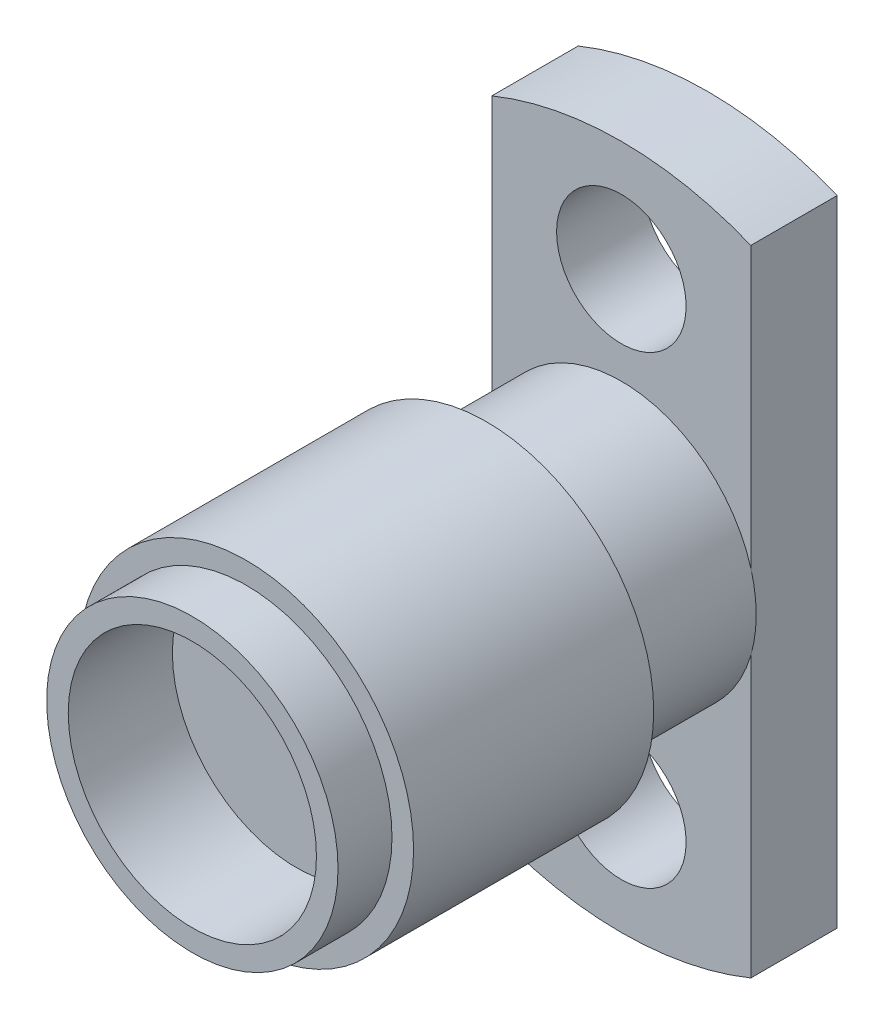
ISO-10303-21;
HEADER;
FILE_DESCRIPTION(('STEP AP214'),'2;1');
FILE_NAME('part.step','',(''),(''),'','','');
FILE_SCHEMA(('AUTOMOTIVE_DESIGN { 1 0 10303 214 1 1 1 1 }'));
ENDSEC;
DATA;
#1=APPLICATION_CONTEXT('core data for automotive mechanical design processes');
#2=APPLICATION_PROTOCOL_DEFINITION('international standard','automotive_design',2000,#1);
#3=PRODUCT_CONTEXT('',#1,'mechanical');
#4=PRODUCT('Part','Part','',(#3));
#5=PRODUCT_RELATED_PRODUCT_CATEGORY('part','',(#4));
#6=PRODUCT_DEFINITION_FORMATION('','',#4);
#7=PRODUCT_DEFINITION_CONTEXT('part definition',#1,'design');
#8=PRODUCT_DEFINITION('design','',#6,#7);
#9=PRODUCT_DEFINITION_SHAPE('','',#8);
#10=(LENGTH_UNIT() NAMED_UNIT(*) SI_UNIT(.MILLI.,.METRE.));
#11=(NAMED_UNIT(*) PLANE_ANGLE_UNIT() SI_UNIT($,.RADIAN.));
#12=(NAMED_UNIT(*) SI_UNIT($,.STERADIAN.) SOLID_ANGLE_UNIT());
#13=UNCERTAINTY_MEASURE_WITH_UNIT(LENGTH_MEASURE(1.E-05),#10,'distance_accuracy_value','');
#14=(GEOMETRIC_REPRESENTATION_CONTEXT(3) GLOBAL_UNCERTAINTY_ASSIGNED_CONTEXT((#13)) GLOBAL_UNIT_ASSIGNED_CONTEXT((#10,
#11,#12)) REPRESENTATION_CONTEXT('',''));
#15=CARTESIAN_POINT('',(0.,0.,0.));
#16=DIRECTION('',(0.,0.,1.));
#17=DIRECTION('',(1.,0.,0.));
#18=AXIS2_PLACEMENT_3D('',#15,#16,#17);
#19=CARTESIAN_POINT('',(15.3944725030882,12.7955932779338,8.55));
#20=DIRECTION('',(0.,0.,1.));
#21=DIRECTION('',(1.,0.,0.));
#22=AXIS2_PLACEMENT_3D('',#19,#20,#21);
#23=PLANE('',#22);
#24=CARTESIAN_POINT('',(15.3944725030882,12.7955932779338,8.55));
#25=DIRECTION('',(0.,0.,1.));
#26=DIRECTION('',(1.,0.,0.));
#27=AXIS2_PLACEMENT_3D('',#24,#25,#26);
#28=CIRCLE('',#27,3.1);
#29=CARTESIAN_POINT('',(18.4944725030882,12.7955932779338,8.55));
#30=VERTEX_POINT('',#29);
#31=EDGE_CURVE('E108',#30,#30,#28,.T.);
#32=ORIENTED_EDGE('',*,*,#31,.T.);
#33=EDGE_LOOP('',(#32));
#34=FACE_BOUND('',#33,.T.);
#35=CARTESIAN_POINT('',(15.3944725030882,12.7955932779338,8.55));
#36=DIRECTION('',(0.,0.,1.));
#37=DIRECTION('',(1.,0.,0.));
#38=AXIS2_PLACEMENT_3D('',#35,#36,#37);
#39=CIRCLE('',#38,2.7);
#40=CARTESIAN_POINT('',(18.0944725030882,12.7955932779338,8.55));
#41=VERTEX_POINT('',#40);
#42=EDGE_CURVE('E379',#41,#41,#39,.T.);
#43=ORIENTED_EDGE('',*,*,#42,.F.);
#44=EDGE_LOOP('',(#43));
#45=FACE_BOUND('',#44,.T.);
#46=ADVANCED_FACE('F35',(#34,#45),#23,.T.);
#47=CARTESIAN_POINT('',(15.3944725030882,12.7955932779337,1.6));
#48=DIRECTION('',(0.,0.,-1.));
#49=DIRECTION('',(-1.,0.,0.));
#50=AXIS2_PLACEMENT_3D('',#47,#48,#49);
#51=PLANE('',#50);
#52=CARTESIAN_POINT('',(15.3944725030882,17.0955932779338,1.6));
#53=DIRECTION('',(0.,0.,-1.));
#54=DIRECTION('',(-1.,0.,0.));
#55=AXIS2_PLACEMENT_3D('',#52,#53,#54);
#56=CIRCLE('',#55,1.20000000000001);
#57=CARTESIAN_POINT('',(14.1944725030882,17.0955932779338,1.6));
#58=VERTEX_POINT('',#57);
#59=EDGE_CURVE('E388',#58,#58,#56,.T.);
#60=ORIENTED_EDGE('',*,*,#59,.T.);
#61=EDGE_LOOP('',(#60));
#62=FACE_BOUND('',#61,.T.);
#63=CARTESIAN_POINT('',(15.3944725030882,12.7955932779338,1.6));
#64=DIRECTION('',(0.,0.,1.));
#65=DIRECTION('',(1.,0.,0.));
#66=AXIS2_PLACEMENT_3D('',#63,#64,#65);
#67=CIRCLE('',#66,2.5);
#68=CARTESIAN_POINT('',(17.7944725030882,13.4955932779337,1.6));
#69=VERTEX_POINT('',#68);
#70=CARTESIAN_POINT('',(12.9944725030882,13.4955932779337,1.6));
#71=VERTEX_POINT('',#70);
#72=EDGE_CURVE('E45',#69,#71,#67,.T.);
#73=ORIENTED_EDGE('',*,*,#72,.F.);
#74=DIRECTION('',(0.,1.,0.));
#75=VECTOR('',#74,1.);
#76=CARTESIAN_POINT('',(17.7944725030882,18.6745812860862,1.6));
#77=LINE('',#76,#75);
#78=CARTESIAN_POINT('',(17.7944725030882,18.6745812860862,1.6));
#79=VERTEX_POINT('',#78);
#80=EDGE_CURVE('E98',#69,#79,#77,.T.);
#81=ORIENTED_EDGE('',*,*,#80,.T.);
#82=CARTESIAN_POINT('',(15.3944725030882,12.7955932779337,1.6));
#83=DIRECTION('',(0.,0.,1.));
#84=DIRECTION('',(-1.,0.,0.));
#85=AXIS2_PLACEMENT_3D('',#82,#83,#84);
#86=CIRCLE('',#85,6.35000000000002);
#87=CARTESIAN_POINT('',(12.9944725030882,18.6745812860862,1.6));
#88=VERTEX_POINT('',#87);
#89=EDGE_CURVE('E118',#79,#88,#86,.T.);
#90=ORIENTED_EDGE('',*,*,#89,.T.);
#91=DIRECTION('',(0.,-1.,0.));
#92=VECTOR('',#91,1.);
#93=CARTESIAN_POINT('',(12.9944725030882,6.91660526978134,1.6));
#94=LINE('',#93,#92);
#95=EDGE_CURVE('E123',#88,#71,#94,.T.);
#96=ORIENTED_EDGE('',*,*,#95,.T.);
#97=EDGE_LOOP('',(#73,#81,#90,#96));
#98=FACE_BOUND('',#97,.T.);
#99=ADVANCED_FACE('F154',(#62,#98),#51,.F.);
#100=CARTESIAN_POINT('',(15.3944725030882,8.49559327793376,1.6));
#101=DIRECTION('',(0.,0.,-1.));
#102=DIRECTION('',(-1.,0.,0.));
#103=AXIS2_PLACEMENT_3D('',#100,#101,#102);
#104=CIRCLE('',#103,1.20000000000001);
#105=CARTESIAN_POINT('',(14.1944725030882,8.49559327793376,1.6));
#106=VERTEX_POINT('',#105);
#107=EDGE_CURVE('E395',#106,#106,#104,.T.);
#108=ORIENTED_EDGE('',*,*,#107,.T.);
#109=EDGE_LOOP('',(#108));
#110=FACE_BOUND('',#109,.T.);
#111=CARTESIAN_POINT('',(12.9944725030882,12.0955932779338,1.6));
#112=VERTEX_POINT('',#111);
#113=CARTESIAN_POINT('',(17.7944725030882,12.0955932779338,1.6));
#114=VERTEX_POINT('',#113);
#115=EDGE_CURVE('E11',#112,#114,#67,.T.);
#116=ORIENTED_EDGE('',*,*,#115,.F.);
#117=CARTESIAN_POINT('',(12.9944725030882,6.91660526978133,1.6));
#118=VERTEX_POINT('',#117);
#119=EDGE_CURVE('E121',#112,#118,#94,.T.);
#120=ORIENTED_EDGE('',*,*,#119,.T.);
#121=CARTESIAN_POINT('',(15.3944725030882,12.7955932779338,1.6));
#122=DIRECTION('',(0.,0.,1.));
#123=DIRECTION('',(-1.,0.,0.));
#124=AXIS2_PLACEMENT_3D('',#121,#122,#123);
#125=CIRCLE('',#124,6.35000000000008);
#126=CARTESIAN_POINT('',(17.7944725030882,6.91660526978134,1.6));
#127=VERTEX_POINT('',#126);
#128=EDGE_CURVE('E91',#118,#127,#125,.T.);
#129=ORIENTED_EDGE('',*,*,#128,.T.);
#130=EDGE_CURVE('E87',#127,#114,#77,.T.);
#131=ORIENTED_EDGE('',*,*,#130,.T.);
#132=EDGE_LOOP('',(#116,#120,#129,#131));
#133=FACE_BOUND('',#132,.T.);
#134=ADVANCED_FACE('F89',(#110,#133),#51,.F.);
#135=CARTESIAN_POINT('',(15.3944725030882,12.7955932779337,1.6));
#136=DIRECTION('',(0.,0.,-1.));
#137=DIRECTION('',(-1.,0.,0.));
#138=AXIS2_PLACEMENT_3D('',#135,#136,#137);
#139=CYLINDRICAL_SURFACE('',#138,6.35000000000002);
#140=CARTESIAN_POINT('',(15.3944725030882,12.7955932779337,0.));
#141=DIRECTION('',(0.,0.,1.));
#142=DIRECTION('',(-1.,0.,0.));
#143=AXIS2_PLACEMENT_3D('',#140,#141,#142);
#144=CIRCLE('',#143,6.35000000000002);
#145=CARTESIAN_POINT('',(17.7944725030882,18.6745812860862,0.));
#146=VERTEX_POINT('',#145);
#147=CARTESIAN_POINT('',(12.9944725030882,18.6745812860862,0.));
#148=VERTEX_POINT('',#147);
#149=EDGE_CURVE('E127',#146,#148,#144,.T.);
#150=ORIENTED_EDGE('',*,*,#149,.T.);
#151=DIRECTION('',(0.,0.,-1.));
#152=VECTOR('',#151,1.);
#153=CARTESIAN_POINT('',(12.9944725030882,18.6745812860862,1.6));
#154=LINE('',#153,#152);
#155=EDGE_CURVE('E39',#88,#148,#154,.T.);
#156=ORIENTED_EDGE('',*,*,#155,.F.);
#157=ORIENTED_EDGE('',*,*,#89,.F.);
#158=DIRECTION('',(0.,0.,-1.));
#159=VECTOR('',#158,1.);
#160=CARTESIAN_POINT('',(17.7944725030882,18.6745812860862,1.6));
#161=LINE('',#160,#159);
#162=EDGE_CURVE('E95',#79,#146,#161,.T.);
#163=ORIENTED_EDGE('',*,*,#162,.T.);
#164=EDGE_LOOP('',(#150,#156,#157,#163));
#165=FACE_BOUND('',#164,.T.);
#166=ADVANCED_FACE('F37',(#165),#139,.T.);
#167=CARTESIAN_POINT('',(12.9944725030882,6.91660526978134,1.6));
#168=DIRECTION('',(1.,0.,0.));
#169=DIRECTION('',(0.,0.,-1.));
#170=AXIS2_PLACEMENT_3D('',#167,#168,#169);
#171=PLANE('',#170);
#172=DIRECTION('',(0.,-1.,0.));
#173=VECTOR('',#172,1.);
#174=CARTESIAN_POINT('',(12.9944725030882,6.91660526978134,0.));
#175=LINE('',#174,#173);
#176=CARTESIAN_POINT('',(12.9944725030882,6.91660526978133,0.));
#177=VERTEX_POINT('',#176);
#178=EDGE_CURVE('E130',#148,#177,#175,.T.);
#179=ORIENTED_EDGE('',*,*,#178,.T.);
#180=DIRECTION('',(0.,0.,-1.));
#181=VECTOR('',#180,1.);
#182=CARTESIAN_POINT('',(12.9944725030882,6.91660526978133,1.6));
#183=LINE('',#182,#181);
#184=EDGE_CURVE('E138',#118,#177,#183,.T.);
#185=ORIENTED_EDGE('',*,*,#184,.F.);
#186=ORIENTED_EDGE('',*,*,#119,.F.);
#187=EDGE_CURVE('E125',#71,#112,#94,.T.);
#188=ORIENTED_EDGE('',*,*,#187,.F.);
#189=ORIENTED_EDGE('',*,*,#95,.F.);
#190=ORIENTED_EDGE('',*,*,#155,.T.);
#191=EDGE_LOOP('',(#179,#185,#186,#188,#189,#190));
#192=FACE_BOUND('',#191,.T.);
#193=ADVANCED_FACE('F146',(#192),#171,.F.);
#194=CARTESIAN_POINT('',(15.3944725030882,12.7955932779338,1.6));
#195=DIRECTION('',(0.,0.,-1.));
#196=DIRECTION('',(-1.,0.,0.));
#197=AXIS2_PLACEMENT_3D('',#194,#195,#196);
#198=CYLINDRICAL_SURFACE('',#197,6.35000000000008);
#199=CARTESIAN_POINT('',(15.3944725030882,12.7955932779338,0.));
#200=DIRECTION('',(0.,0.,1.));
#201=DIRECTION('',(-1.,0.,0.));
#202=AXIS2_PLACEMENT_3D('',#199,#200,#201);
#203=CIRCLE('',#202,6.35000000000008);
#204=CARTESIAN_POINT('',(17.7944725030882,6.91660526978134,0.));
#205=VERTEX_POINT('',#204);
#206=EDGE_CURVE('E132',#177,#205,#203,.T.);
#207=ORIENTED_EDGE('',*,*,#206,.T.);
#208=DIRECTION('',(0.,0.,-1.));
#209=VECTOR('',#208,1.);
#210=CARTESIAN_POINT('',(17.7944725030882,6.91660526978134,1.6));
#211=LINE('',#210,#209);
#212=EDGE_CURVE('E137',#127,#205,#211,.T.);
#213=ORIENTED_EDGE('',*,*,#212,.F.);
#214=ORIENTED_EDGE('',*,*,#128,.F.);
#215=ORIENTED_EDGE('',*,*,#184,.T.);
#216=EDGE_LOOP('',(#207,#213,#214,#215));
#217=FACE_BOUND('',#216,.T.);
#218=ADVANCED_FACE('F153',(#217),#198,.T.);
#219=CARTESIAN_POINT('',(17.7944725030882,18.6745812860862,1.6));
#220=DIRECTION('',(-1.,0.,0.));
#221=DIRECTION('',(0.,0.,1.));
#222=AXIS2_PLACEMENT_3D('',#219,#220,#221);
#223=PLANE('',#222);
#224=DIRECTION('',(0.,1.,0.));
#225=VECTOR('',#224,1.);
#226=CARTESIAN_POINT('',(17.7944725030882,18.6745812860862,0.));
#227=LINE('',#226,#225);
#228=EDGE_CURVE('E122',#205,#146,#227,.T.);
#229=ORIENTED_EDGE('',*,*,#228,.T.);
#230=ORIENTED_EDGE('',*,*,#162,.F.);
#231=ORIENTED_EDGE('',*,*,#80,.F.);
#232=EDGE_CURVE('E96',#114,#69,#77,.T.);
#233=ORIENTED_EDGE('',*,*,#232,.F.);
#234=ORIENTED_EDGE('',*,*,#130,.F.);
#235=ORIENTED_EDGE('',*,*,#212,.T.);
#236=EDGE_LOOP('',(#229,#230,#231,#233,#234,#235));
#237=FACE_BOUND('',#236,.T.);
#238=ADVANCED_FACE('F101',(#237),#223,.F.);
#239=CARTESIAN_POINT('',(15.3944725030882,12.7955932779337,0.));
#240=DIRECTION('',(0.,0.,-1.));
#241=DIRECTION('',(-1.,0.,0.));
#242=AXIS2_PLACEMENT_3D('',#239,#240,#241);
#243=PLANE('',#242);
#244=CARTESIAN_POINT('',(15.3944725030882,8.49559327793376,0.));
#245=DIRECTION('',(0.,0.,-1.));
#246=DIRECTION('',(-1.,0.,0.));
#247=AXIS2_PLACEMENT_3D('',#244,#245,#246);
#248=CIRCLE('',#247,1.20000000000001);
#249=CARTESIAN_POINT('',(14.1944725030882,8.49559327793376,0.));
#250=VERTEX_POINT('',#249);
#251=EDGE_CURVE('E398',#250,#250,#248,.T.);
#252=ORIENTED_EDGE('',*,*,#251,.F.);
#253=EDGE_LOOP('',(#252));
#254=FACE_BOUND('',#253,.T.);
#255=CARTESIAN_POINT('',(15.3944725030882,17.0955932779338,0.));
#256=DIRECTION('',(0.,0.,-1.));
#257=DIRECTION('',(-1.,0.,0.));
#258=AXIS2_PLACEMENT_3D('',#255,#256,#257);
#259=CIRCLE('',#258,1.20000000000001);
#260=CARTESIAN_POINT('',(14.1944725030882,17.0955932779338,0.));
#261=VERTEX_POINT('',#260);
#262=EDGE_CURVE('E392',#261,#261,#259,.T.);
#263=ORIENTED_EDGE('',*,*,#262,.F.);
#264=EDGE_LOOP('',(#263));
#265=FACE_BOUND('',#264,.T.);
#266=CARTESIAN_POINT('',(15.3944725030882,12.7955932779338,0.));
#267=DIRECTION('',(0.,0.,-1.));
#268=DIRECTION('',(-1.,0.,0.));
#269=AXIS2_PLACEMENT_3D('',#266,#267,#268);
#270=CIRCLE('',#269,0.17500000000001);
#271=CARTESIAN_POINT('',(15.2194725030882,12.7955932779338,0.));
#272=VERTEX_POINT('',#271);
#273=EDGE_CURVE('E385',#272,#272,#270,.T.);
#274=ORIENTED_EDGE('',*,*,#273,.F.);
#275=EDGE_LOOP('',(#274));
#276=FACE_BOUND('',#275,.T.);
#277=ORIENTED_EDGE('',*,*,#149,.F.);
#278=ORIENTED_EDGE('',*,*,#228,.F.);
#279=ORIENTED_EDGE('',*,*,#206,.F.);
#280=ORIENTED_EDGE('',*,*,#178,.F.);
#281=EDGE_LOOP('',(#277,#278,#279,#280));
#282=FACE_BOUND('',#281,.T.);
#283=ADVANCED_FACE('F152',(#254,#265,#276,#282),#243,.T.);
#284=CARTESIAN_POINT('',(15.3944725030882,12.7955932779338,1.6));
#285=DIRECTION('',(0.,0.,1.));
#286=DIRECTION('',(1.,0.,0.));
#287=AXIS2_PLACEMENT_3D('',#284,#285,#286);
#288=PLANE('',#287);
#289=EDGE_CURVE('E46',#71,#112,#67,.T.);
#290=ORIENTED_EDGE('',*,*,#289,.F.);
#291=ORIENTED_EDGE('',*,*,#187,.T.);
#292=EDGE_LOOP('',(#290,#291));
#293=FACE_BOUND('',#292,.T.);
#294=ADVANCED_FACE('F171',(#293),#288,.F.);
#295=EDGE_CURVE('E105',#114,#69,#67,.T.);
#296=ORIENTED_EDGE('',*,*,#295,.F.);
#297=ORIENTED_EDGE('',*,*,#232,.T.);
#298=EDGE_LOOP('',(#296,#297));
#299=FACE_BOUND('',#298,.T.);
#300=ADVANCED_FACE('F106',(#299),#288,.F.);
#301=CARTESIAN_POINT('',(15.3944725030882,12.7955932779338,4.1));
#302=DIRECTION('',(0.,0.,-1.));
#303=DIRECTION('',(-1.,0.,0.));
#304=AXIS2_PLACEMENT_3D('',#301,#302,#303);
#305=CYLINDRICAL_SURFACE('',#304,2.5);
#306=CARTESIAN_POINT('',(15.3944725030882,12.7955932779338,4.1));
#307=DIRECTION('',(0.,0.,1.));
#308=DIRECTION('',(1.,0.,0.));
#309=AXIS2_PLACEMENT_3D('',#306,#307,#308);
#310=CIRCLE('',#309,2.5);
#311=CARTESIAN_POINT('',(17.8944725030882,12.7955932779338,4.1));
#312=VERTEX_POINT('',#311);
#313=EDGE_CURVE('E114',#312,#312,#310,.T.);
#314=ORIENTED_EDGE('',*,*,#313,.F.);
#315=EDGE_LOOP('',(#314));
#316=FACE_BOUND('',#315,.T.);
#317=ORIENTED_EDGE('',*,*,#72,.T.);
#318=ORIENTED_EDGE('',*,*,#289,.T.);
#319=ORIENTED_EDGE('',*,*,#115,.T.);
#320=ORIENTED_EDGE('',*,*,#295,.T.);
#321=EDGE_LOOP('',(#317,#318,#319,#320));
#322=FACE_BOUND('',#321,.T.);
#323=ADVANCED_FACE('F110',(#316,#322),#305,.T.);
#324=CARTESIAN_POINT('',(15.3944725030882,12.7955932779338,4.1));
#325=DIRECTION('',(0.,0.,1.));
#326=DIRECTION('',(1.,0.,0.));
#327=AXIS2_PLACEMENT_3D('',#324,#325,#326);
#328=PLANE('',#327);
#329=CARTESIAN_POINT('',(15.3944725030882,12.7955932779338,4.1));
#330=DIRECTION('',(0.,0.,1.));
#331=DIRECTION('',(1.,0.,0.));
#332=AXIS2_PLACEMENT_3D('',#329,#330,#331);
#333=CIRCLE('',#332,3.1);
#334=CARTESIAN_POINT('',(18.4944725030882,12.7955932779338,4.1));
#335=VERTEX_POINT('',#334);
#336=EDGE_CURVE('E375',#335,#335,#333,.T.);
#337=ORIENTED_EDGE('',*,*,#336,.F.);
#338=EDGE_LOOP('',(#337));
#339=FACE_BOUND('',#338,.T.);
#340=ORIENTED_EDGE('',*,*,#313,.T.);
#341=EDGE_LOOP('',(#340));
#342=FACE_BOUND('',#341,.T.);
#343=ADVANCED_FACE('F290',(#339,#342),#328,.F.);
#344=CARTESIAN_POINT('',(15.3944725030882,12.7955932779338,8.55));
#345=DIRECTION('',(0.,0.,-1.));
#346=DIRECTION('',(-1.,0.,0.));
#347=AXIS2_PLACEMENT_3D('',#344,#345,#346);
#348=CYLINDRICAL_SURFACE('',#347,3.1);
#349=ORIENTED_EDGE('',*,*,#31,.F.);
#350=EDGE_LOOP('',(#349));
#351=FACE_BOUND('',#350,.T.);
#352=ORIENTED_EDGE('',*,*,#336,.T.);
#353=EDGE_LOOP('',(#352));
#354=FACE_BOUND('',#353,.T.);
#355=ADVANCED_FACE('F287',(#351,#354),#348,.T.);
#356=CARTESIAN_POINT('',(15.3944725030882,12.7955932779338,9.55));
#357=DIRECTION('',(0.,0.,-1.));
#358=DIRECTION('',(-1.,0.,0.));
#359=AXIS2_PLACEMENT_3D('',#356,#357,#358);
#360=CYLINDRICAL_SURFACE('',#359,2.7);
#361=CARTESIAN_POINT('',(15.3944725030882,12.7955932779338,9.55));
#362=DIRECTION('',(0.,0.,1.));
#363=DIRECTION('',(1.,0.,0.));
#364=AXIS2_PLACEMENT_3D('',#361,#362,#363);
#365=CIRCLE('',#364,2.7);
#366=CARTESIAN_POINT('',(18.0944725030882,12.7955932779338,9.55));
#367=VERTEX_POINT('',#366);
#368=EDGE_CURVE('E376',#367,#367,#365,.T.);
#369=ORIENTED_EDGE('',*,*,#368,.F.);
#370=EDGE_LOOP('',(#369));
#371=FACE_BOUND('',#370,.T.);
#372=ORIENTED_EDGE('',*,*,#42,.T.);
#373=EDGE_LOOP('',(#372));
#374=FACE_BOUND('',#373,.T.);
#375=ADVANCED_FACE('F235',(#371,#374),#360,.T.);
#376=CARTESIAN_POINT('',(15.3944725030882,12.7955932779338,9.55));
#377=DIRECTION('',(0.,0.,1.));
#378=DIRECTION('',(1.,0.,0.));
#379=AXIS2_PLACEMENT_3D('',#376,#377,#378);
#380=PLANE('',#379);
#381=CARTESIAN_POINT('',(15.3944725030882,12.7955932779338,9.55));
#382=DIRECTION('',(0.,0.,1.));
#383=DIRECTION('',(1.,0.,0.));
#384=AXIS2_PLACEMENT_3D('',#381,#382,#383);
#385=CIRCLE('',#384,2.3);
#386=CARTESIAN_POINT('',(17.6944725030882,12.7955932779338,9.55));
#387=VERTEX_POINT('',#386);
#388=EDGE_CURVE('E402',#387,#387,#385,.T.);
#389=ORIENTED_EDGE('',*,*,#388,.F.);
#390=EDGE_LOOP('',(#389));
#391=FACE_BOUND('',#390,.T.);
#392=ORIENTED_EDGE('',*,*,#368,.T.);
#393=EDGE_LOOP('',(#392));
#394=FACE_BOUND('',#393,.T.);
#395=ADVANCED_FACE('F229',(#391,#394),#380,.T.);
#396=CARTESIAN_POINT('',(15.3944725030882,12.7955932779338,2.));
#397=DIRECTION('',(0.,0.,-1.));
#398=DIRECTION('',(-1.,0.,0.));
#399=AXIS2_PLACEMENT_3D('',#396,#397,#398);
#400=CYLINDRICAL_SURFACE('',#399,0.17500000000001);
#401=CARTESIAN_POINT('',(15.3944725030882,12.7955932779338,2.));
#402=DIRECTION('',(0.,0.,-1.));
#403=DIRECTION('',(-1.,0.,0.));
#404=AXIS2_PLACEMENT_3D('',#401,#402,#403);
#405=CIRCLE('',#404,0.17500000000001);
#406=CARTESIAN_POINT('',(15.2194725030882,12.7955932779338,2.));
#407=VERTEX_POINT('',#406);
#408=EDGE_CURVE('E383',#407,#407,#405,.T.);
#409=ORIENTED_EDGE('',*,*,#408,.F.);
#410=EDGE_LOOP('',(#409));
#411=FACE_BOUND('',#410,.T.);
#412=ORIENTED_EDGE('',*,*,#273,.T.);
#413=EDGE_LOOP('',(#412));
#414=FACE_BOUND('',#413,.T.);
#415=ADVANCED_FACE('F234',(#411,#414),#400,.F.);
#416=CARTESIAN_POINT('',(15.3944725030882,12.7955932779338,2.));
#417=DIRECTION('',(0.,0.,-1.));
#418=DIRECTION('',(-1.,0.,0.));
#419=AXIS2_PLACEMENT_3D('',#416,#417,#418);
#420=PLANE('',#419);
#421=ORIENTED_EDGE('',*,*,#408,.T.);
#422=EDGE_LOOP('',(#421));
#423=FACE_BOUND('',#422,.T.);
#424=ADVANCED_FACE('F209',(#423),#420,.T.);
#425=CARTESIAN_POINT('',(15.3944725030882,17.0955932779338,2.));
#426=DIRECTION('',(0.,0.,-1.));
#427=DIRECTION('',(-1.,0.,0.));
#428=AXIS2_PLACEMENT_3D('',#425,#426,#427);
#429=CYLINDRICAL_SURFACE('',#428,1.20000000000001);
#430=ORIENTED_EDGE('',*,*,#262,.T.);
#431=EDGE_LOOP('',(#430));
#432=FACE_BOUND('',#431,.T.);
#433=ORIENTED_EDGE('',*,*,#59,.F.);
#434=EDGE_LOOP('',(#433));
#435=FACE_BOUND('',#434,.T.);
#436=ADVANCED_FACE('F203',(#432,#435),#429,.F.);
#437=CARTESIAN_POINT('',(15.3944725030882,8.49559327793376,2.));
#438=DIRECTION('',(0.,0.,-1.));
#439=DIRECTION('',(-1.,0.,0.));
#440=AXIS2_PLACEMENT_3D('',#437,#438,#439);
#441=CYLINDRICAL_SURFACE('',#440,1.20000000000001);
#442=ORIENTED_EDGE('',*,*,#251,.T.);
#443=EDGE_LOOP('',(#442));
#444=FACE_BOUND('',#443,.T.);
#445=ORIENTED_EDGE('',*,*,#107,.F.);
#446=EDGE_LOOP('',(#445));
#447=FACE_BOUND('',#446,.T.);
#448=ADVANCED_FACE('F208',(#444,#447),#441,.F.);
#449=CARTESIAN_POINT('',(15.3944725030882,12.7955932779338,7.62));
#450=DIRECTION('',(0.,0.,1.));
#451=DIRECTION('',(1.,0.,0.));
#452=AXIS2_PLACEMENT_3D('',#449,#450,#451);
#453=CYLINDRICAL_SURFACE('',#452,2.3);
#454=CARTESIAN_POINT('',(15.3944725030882,12.7955932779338,7.62));
#455=DIRECTION('',(0.,0.,1.));
#456=DIRECTION('',(1.,0.,0.));
#457=AXIS2_PLACEMENT_3D('',#454,#455,#456);
#458=CIRCLE('',#457,2.3);
#459=CARTESIAN_POINT('',(17.6944725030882,12.7955932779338,7.62));
#460=VERTEX_POINT('',#459);
#461=EDGE_CURVE('E401',#460,#460,#458,.T.);
#462=ORIENTED_EDGE('',*,*,#461,.F.);
#463=EDGE_LOOP('',(#462));
#464=FACE_BOUND('',#463,.T.);
#465=ORIENTED_EDGE('',*,*,#388,.T.);
#466=EDGE_LOOP('',(#465));
#467=FACE_BOUND('',#466,.T.);
#468=ADVANCED_FACE('F221',(#464,#467),#453,.F.);
#469=CARTESIAN_POINT('',(15.3944725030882,12.7955932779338,7.62));
#470=DIRECTION('',(0.,0.,1.));
#471=DIRECTION('',(1.,0.,0.));
#472=AXIS2_PLACEMENT_3D('',#469,#470,#471);
#473=PLANE('',#472);
#474=CARTESIAN_POINT('',(15.3944725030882,12.7955932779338,7.62));
#475=DIRECTION('',(0.,0.,1.));
#476=DIRECTION('',(1.,0.,0.));
#477=AXIS2_PLACEMENT_3D('',#474,#475,#476);
#478=CIRCLE('',#477,0.17500000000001);
#479=CARTESIAN_POINT('',(15.5694725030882,12.7955932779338,7.62));
#480=VERTEX_POINT('',#479);
#481=EDGE_CURVE('E408',#480,#480,#478,.T.);
#482=ORIENTED_EDGE('',*,*,#481,.F.);
#483=EDGE_LOOP('',(#482));
#484=FACE_BOUND('',#483,.T.);
#485=ORIENTED_EDGE('',*,*,#461,.T.);
#486=EDGE_LOOP('',(#485));
#487=FACE_BOUND('',#486,.T.);
#488=ADVANCED_FACE('F247',(#484,#487),#473,.T.);
#489=CARTESIAN_POINT('',(15.3944725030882,12.7955932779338,5.12));
#490=DIRECTION('',(0.,0.,1.));
#491=DIRECTION('',(1.,0.,0.));
#492=AXIS2_PLACEMENT_3D('',#489,#490,#491);
#493=CYLINDRICAL_SURFACE('',#492,0.17500000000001);
#494=CARTESIAN_POINT('',(15.3944725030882,12.7955932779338,5.12));
#495=DIRECTION('',(0.,0.,1.));
#496=DIRECTION('',(1.,0.,0.));
#497=AXIS2_PLACEMENT_3D('',#494,#495,#496);
#498=CIRCLE('',#497,0.17500000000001);
#499=CARTESIAN_POINT('',(15.5694725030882,12.7955932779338,5.12));
#500=VERTEX_POINT('',#499);
#501=EDGE_CURVE('E405',#500,#500,#498,.T.);
#502=ORIENTED_EDGE('',*,*,#501,.F.);
#503=EDGE_LOOP('',(#502));
#504=FACE_BOUND('',#503,.T.);
#505=ORIENTED_EDGE('',*,*,#481,.T.);
#506=EDGE_LOOP('',(#505));
#507=FACE_BOUND('',#506,.T.);
#508=ADVANCED_FACE('F257',(#504,#507),#493,.F.);
#509=CARTESIAN_POINT('',(15.3944725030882,12.7955932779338,5.12));
#510=DIRECTION('',(0.,0.,1.));
#511=DIRECTION('',(1.,0.,0.));
#512=AXIS2_PLACEMENT_3D('',#509,#510,#511);
#513=PLANE('',#512);
#514=ORIENTED_EDGE('',*,*,#501,.T.);
#515=EDGE_LOOP('',(#514));
#516=FACE_BOUND('',#515,.T.);
#517=ADVANCED_FACE('F267',(#516),#513,.T.);
#518=CLOSED_SHELL('',(#46,#99,#134,#166,#193,#218,#238,#283,#294,#300,#323,#343,#355,#375,#395,
#415,#424,#436,#448,#468,#488,#508,#517));
#519=MANIFOLD_SOLID_BREP('B2',#518);
#520=ADVANCED_BREP_SHAPE_REPRESENTATION('',(#18,#519),#14);
#521=SHAPE_DEFINITION_REPRESENTATION(#9,#520);
ENDSEC;
END-ISO-10303-21;
